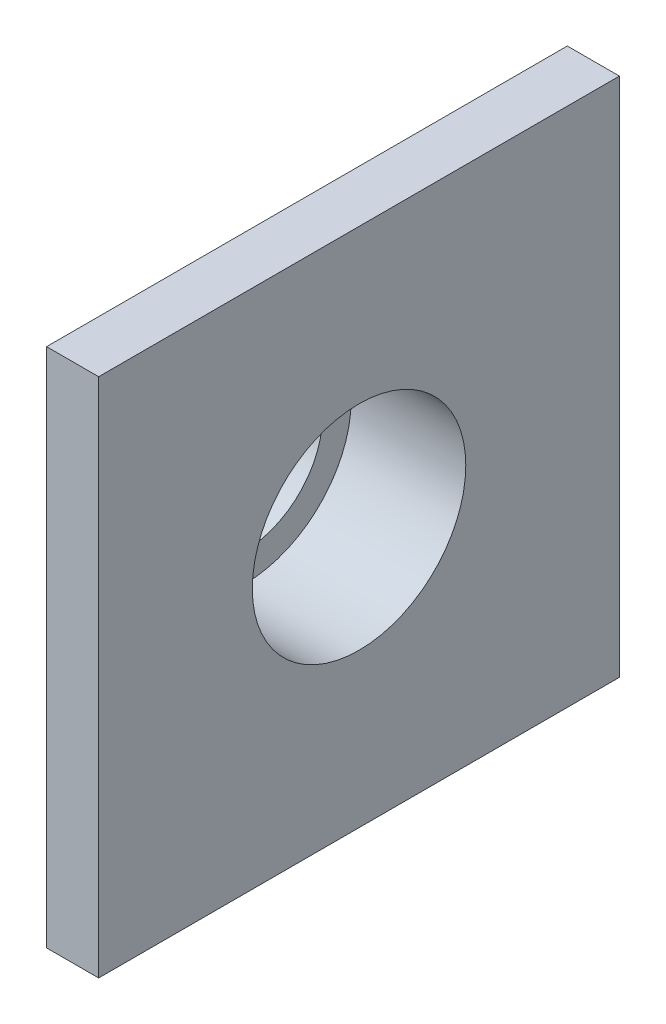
from build123d import *

# Parameters (mm, degrees)
SKETCH1_R           = 2.5
SKETCH1_R_2         = 1.5
BOSS_EXTRUDE1_DEPTH = 1
SKETCH2_R           = 2.5
SKETCH2_R_2         = 2.05
BOSS_EXTRUDE2_DEPTH = 1.2
SKETCH3_W           = 10
SKETCH3_H           = 10
SKETCH3_R           = 2.05
BOSS_EXTRUDE3_DEPTH = 1


with BuildPart() as part:
    # Sketch1 → Boss-Extrude1 (new body)
    with BuildSketch(Plane(origin=(0, 0, 0), x_dir=(0, 0, -1), z_dir=(1, 0, 0))):
        Circle(SKETCH1_R)
        Circle(SKETCH1_R_2, mode=Mode.SUBTRACT)
    extrude(amount=BOSS_EXTRUDE1_DEPTH)

    # Sketch2 → Boss-Extrude2 (add)
    with BuildSketch(Plane(origin=(1, 0, 0), x_dir=(0, 0, -1), z_dir=(1, 0, 0))):
        Circle(SKETCH2_R)
        Circle(SKETCH2_R_2, mode=Mode.SUBTRACT)
    extrude(amount=BOSS_EXTRUDE2_DEPTH)

    # Sketch3 → Boss-Extrude3 (add)
    with BuildSketch(Plane(origin=(2.2, 0, 0), x_dir=(0, 0, -1), z_dir=(1, 0, 0))):
        Rectangle(SKETCH3_W, SKETCH3_H)
        Circle(SKETCH3_R, mode=Mode.SUBTRACT)
    extrude(amount=BOSS_EXTRUDE3_DEPTH)


solid = part.part
